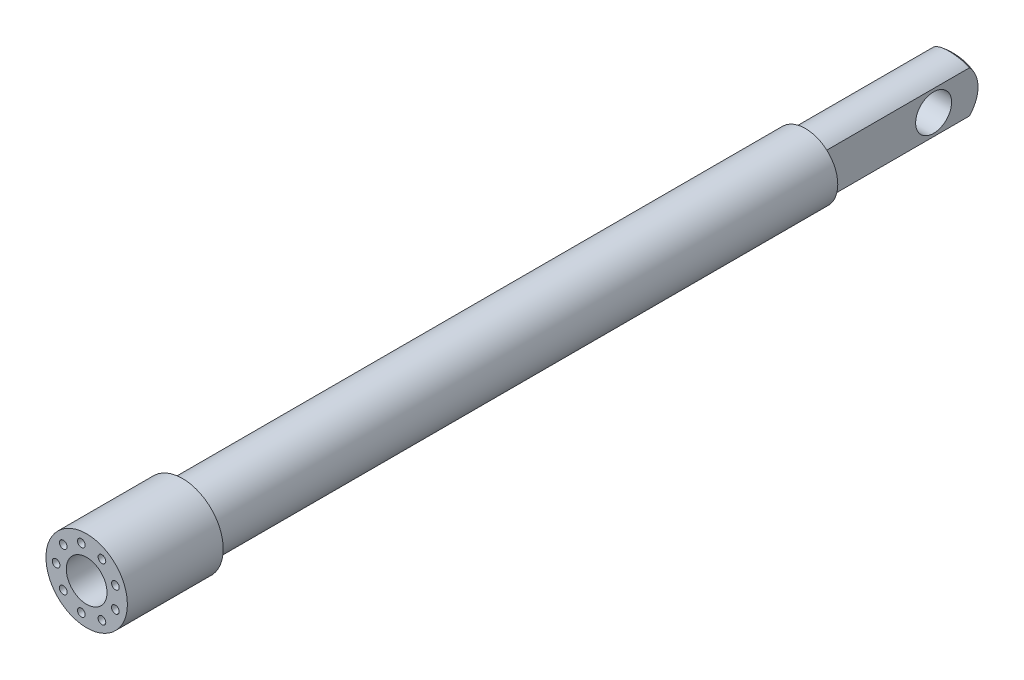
ISO-10303-21;
HEADER;
FILE_DESCRIPTION(('STEP AP214'),'2;1');
FILE_NAME('part.step','',(''),(''),'','','');
FILE_SCHEMA(('AUTOMOTIVE_DESIGN { 1 0 10303 214 1 1 1 1 }'));
ENDSEC;
DATA;
#1=APPLICATION_CONTEXT('core data for automotive mechanical design processes');
#2=APPLICATION_PROTOCOL_DEFINITION('international standard','automotive_design',2000,#1);
#3=PRODUCT_CONTEXT('',#1,'mechanical');
#4=PRODUCT('Part','Part','',(#3));
#5=PRODUCT_RELATED_PRODUCT_CATEGORY('part','',(#4));
#6=PRODUCT_DEFINITION_FORMATION('','',#4);
#7=PRODUCT_DEFINITION_CONTEXT('part definition',#1,'design');
#8=PRODUCT_DEFINITION('design','',#6,#7);
#9=PRODUCT_DEFINITION_SHAPE('','',#8);
#10=(LENGTH_UNIT() NAMED_UNIT(*) SI_UNIT(.MILLI.,.METRE.));
#11=(NAMED_UNIT(*) PLANE_ANGLE_UNIT() SI_UNIT($,.RADIAN.));
#12=(NAMED_UNIT(*) SI_UNIT($,.STERADIAN.) SOLID_ANGLE_UNIT());
#13=UNCERTAINTY_MEASURE_WITH_UNIT(LENGTH_MEASURE(1.E-05),#10,'distance_accuracy_value','');
#14=(GEOMETRIC_REPRESENTATION_CONTEXT(3) GLOBAL_UNCERTAINTY_ASSIGNED_CONTEXT((#13)) GLOBAL_UNIT_ASSIGNED_CONTEXT((#10,
#11,#12)) REPRESENTATION_CONTEXT('',''));
#15=CARTESIAN_POINT('',(0.,0.,0.));
#16=DIRECTION('',(0.,0.,1.));
#17=DIRECTION('',(1.,0.,0.));
#18=AXIS2_PLACEMENT_3D('',#15,#16,#17);
#19=CARTESIAN_POINT('',(0.,0.,-1850.));
#20=DIRECTION('',(0.,0.,1.));
#21=DIRECTION('',(1.,0.,0.));
#22=AXIS2_PLACEMENT_3D('',#19,#20,#21);
#23=CYLINDRICAL_SURFACE('',#22,57.5);
#24=CARTESIAN_POINT('',(-37.5,43.5889894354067,-1805.));
#25=CARTESIAN_POINT('',(-36.9034025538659,44.102251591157,-1804.83220902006));
#26=CARTESIAN_POINT('',(-36.2961876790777,44.6033262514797,-1804.66486884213));
#27=CARTESIAN_POINT('',(-35.061183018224,45.5805173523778,-1804.33216744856));
#28=CARTESIAN_POINT('',(-34.4333875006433,46.0566267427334,-1804.16680680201));
#29=CARTESIAN_POINT('',(-33.1581229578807,46.9830836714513,-1803.83921304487));
#30=CARTESIAN_POINT('',(-32.510651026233,47.4334273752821,-1803.67698040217));
#31=CARTESIAN_POINT('',(-31.1969594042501,48.3075793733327,-1803.35680326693));
#32=CARTESIAN_POINT('',(-30.5307389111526,48.7313865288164,-1803.19885895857));
#33=CARTESIAN_POINT('',(-29.1781653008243,49.5531329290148,-1802.88788306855));
#34=CARTESIAN_POINT('',(-28.491751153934,49.9509788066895,-1802.73487012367));
#35=CARTESIAN_POINT('',(-27.1019802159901,50.7184655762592,-1802.43549675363));
#36=CARTESIAN_POINT('',(-26.3986246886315,51.0881085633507,-1802.28913583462));
#37=CARTESIAN_POINT('',(-24.9759593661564,51.7984897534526,-1802.00421358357));
#38=CARTESIAN_POINT('',(-24.2566504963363,52.1392296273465,-1801.86565180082));
#39=CARTESIAN_POINT('',(-22.8031162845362,52.7911203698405,-1801.59745208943));
#40=CARTESIAN_POINT('',(-22.0688906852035,53.1022707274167,-1801.46781431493));
#41=CARTESIAN_POINT('',(-20.3368868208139,53.7940445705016,-1801.17656833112));
#42=CARTESIAN_POINT('',(-19.3336532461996,54.1627576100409,-1801.01890332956));
#43=CARTESIAN_POINT('',(-17.3054588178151,54.8444690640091,-1800.72400231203));
#44=CARTESIAN_POINT('',(-16.280497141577,55.1574653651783,-1800.58676707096));
#45=CARTESIAN_POINT('',(-14.2120401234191,55.7262808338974,-1800.33500942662));
#46=CARTESIAN_POINT('',(-13.1685445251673,55.9820992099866,-1800.22048733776));
#47=CARTESIAN_POINT('',(-11.0686702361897,56.4347919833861,-1800.01636212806));
#48=CARTESIAN_POINT('',(-10.0123221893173,56.631785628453,-1799.92670862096));
#49=CARTESIAN_POINT('',(-7.88839565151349,56.9664727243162,-1799.77362273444));
#50=CARTESIAN_POINT('',(-6.82081723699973,57.1041665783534,-1799.7101901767));
#51=CARTESIAN_POINT('',(-4.67838378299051,57.3194689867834,-1799.61072637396));
#52=CARTESIAN_POINT('',(-3.60352936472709,57.3970826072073,-1799.57469281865));
#53=CARTESIAN_POINT('',(-1.77007023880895,57.4777466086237,-1799.53721522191));
#54=CARTESIAN_POINT('',(-1.01223942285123,57.4960861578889,-1799.52868116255));
#55=CARTESIAN_POINT('',(0.50364962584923,57.502789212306,-1799.52556364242));
#56=CARTESIAN_POINT('',(1.26170786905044,57.4911510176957,-1799.53098097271));
#57=CARTESIAN_POINT('',(2.77645316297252,57.4379282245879,-1799.55571876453));
#58=CARTESIAN_POINT('',(3.53314035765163,57.3963469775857,-1799.57503767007));
#59=CARTESIAN_POINT('',(5.04388212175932,57.2833577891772,-1799.62739761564));
#60=CARTESIAN_POINT('',(5.79793642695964,57.2119469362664,-1799.66043999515));
#61=CARTESIAN_POINT('',(7.30241576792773,57.0394459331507,-1799.73996644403));
#62=CARTESIAN_POINT('',(8.05283818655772,56.9383369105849,-1799.78645906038));
#63=CARTESIAN_POINT('',(9.54827906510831,56.7067275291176,-1799.8924571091));
#64=CARTESIAN_POINT('',(10.2932969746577,56.5762242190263,-1799.95196384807));
#65=CARTESIAN_POINT('',(11.7764686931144,56.2861939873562,-1800.08344930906));
#66=CARTESIAN_POINT('',(12.5146232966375,56.1266704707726,-1800.15542656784));
#67=CARTESIAN_POINT('',(13.9829205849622,55.7790048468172,-1800.31122394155));
#68=CARTESIAN_POINT('',(14.7130625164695,55.5908600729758,-1800.39504515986));
#69=CARTESIAN_POINT('',(16.8566202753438,54.9933644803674,-1800.65916063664));
#70=CARTESIAN_POINT('',(18.2572548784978,54.5442381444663,-1800.85519324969));
#71=CARTESIAN_POINT('',(21.0149987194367,53.5422554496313,-1801.28377684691));
#72=CARTESIAN_POINT('',(22.3721049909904,52.9893920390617,-1801.51633031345));
#73=CARTESIAN_POINT('',(25.0348045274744,51.784578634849,-1802.01104852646));
#74=CARTESIAN_POINT('',(26.3404316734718,51.1326952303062,-1802.27319334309));
#75=CARTESIAN_POINT('',(28.8944989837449,49.7340606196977,-1802.82011242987));
#76=CARTESIAN_POINT('',(30.1429562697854,48.9873380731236,-1803.10487985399));
#77=CARTESIAN_POINT('',(31.8978062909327,47.8455031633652,-1803.52662848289));
#78=CARTESIAN_POINT('',(32.4296152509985,47.486643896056,-1803.65742605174));
#79=CARTESIAN_POINT('',(33.4804530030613,46.7516864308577,-1803.92141598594));
#80=CARTESIAN_POINT('',(33.9994843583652,46.3755917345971,-1804.05460786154));
#81=CARTESIAN_POINT('',(35.0232977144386,45.6073173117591,-1804.32250880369));
#82=CARTESIAN_POINT('',(35.5281075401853,45.2151733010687,-1804.45721406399));
#83=CARTESIAN_POINT('',(36.5242775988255,44.4143631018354,-1804.72784631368));
#84=CARTESIAN_POINT('',(37.0156352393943,44.0056937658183,-1804.86377353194));
#85=CARTESIAN_POINT('',(37.5,43.5889894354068,-1805.));
#86=B_SPLINE_CURVE_WITH_KNOTS('',3,(#24,#25,#26,#27,#28,#29,#30,#31,#32,#33,#34,#35,#36,#37,#38,
#39,#40,#41,#42,#43,#44,#45,#46,#47,#48,#49,#50,#51,#52,#53,#54,#55,#56,#57,#58,#59,#60,#61,#62,
#63,#64,#65,#66,#67,#68,#69,#70,#71,#72,#73,#74,#75,#76,#77,#78,#79,#80,#81,#82,#83,#84,#85),
.UNSPECIFIED.,.F.,.F.,(4,2,2,2,2,2,2,2,2,2,2,2,2,2,2,2,2,2,2,2,2,2,2,2,2,2,2,2,2,2,4),(0.,
2.4139037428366,4.82848554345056,7.24342576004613,9.65846953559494,12.0817678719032,
14.5048860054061,16.9278639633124,19.3508837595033,22.5902167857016,25.8296726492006,
29.0691733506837,32.3020617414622,35.5349281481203,38.7675219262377,41.0411580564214,
43.3149231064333,45.5884336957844,47.8621662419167,50.1373468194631,52.4127559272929,
54.6878982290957,56.9632526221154,61.4096497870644,65.8563493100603,70.3000716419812,
74.7424543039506,76.706457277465,78.6700629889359,80.6295141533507,82.589340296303),.UNSPECIFIED.);
#87=CARTESIAN_POINT('',(-37.5,43.5889894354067,-1805.));
#88=VERTEX_POINT('',#87);
#89=CARTESIAN_POINT('',(37.5,43.5889894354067,-1805.));
#90=VERTEX_POINT('',#89);
#91=EDGE_CURVE('E79',#88,#90,#86,.T.);
#92=ORIENTED_EDGE('',*,*,#91,.F.);
#93=DIRECTION('',(0.,0.,1.));
#94=VECTOR('',#93,1.);
#95=CARTESIAN_POINT('',(-37.5,43.5889894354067,-1850.));
#96=LINE('',#95,#94);
#97=CARTESIAN_POINT('',(-37.4999999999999,43.5889894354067,-1500.));
#98=VERTEX_POINT('',#97);
#99=EDGE_CURVE('E84',#88,#98,#96,.T.);
#100=ORIENTED_EDGE('',*,*,#99,.T.);
#101=CARTESIAN_POINT('',(0.,0.,-1500.));
#102=DIRECTION('',(0.,0.,1.));
#103=DIRECTION('',(1.,0.,0.));
#104=AXIS2_PLACEMENT_3D('',#101,#102,#103);
#105=CIRCLE('',#104,57.5);
#106=CARTESIAN_POINT('',(37.5,43.5889894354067,-1500.));
#107=VERTEX_POINT('',#106);
#108=EDGE_CURVE('E61',#98,#107,#105,.F.);
#109=ORIENTED_EDGE('',*,*,#108,.T.);
#110=DIRECTION('',(0.,0.,1.));
#111=VECTOR('',#110,1.);
#112=CARTESIAN_POINT('',(37.5,43.5889894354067,-1850.));
#113=LINE('',#112,#111);
#114=EDGE_CURVE('E86',#107,#90,#113,.F.);
#115=ORIENTED_EDGE('',*,*,#114,.T.);
#116=EDGE_LOOP('',(#92,#100,#109,#115));
#117=FACE_BOUND('',#116,.T.);
#118=ADVANCED_FACE('F34',(#117),#23,.T.);
#119=CARTESIAN_POINT('',(37.5,-43.5889894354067,-1805.));
#120=CARTESIAN_POINT('',(36.903402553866,-44.102251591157,-1804.83220902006));
#121=CARTESIAN_POINT('',(36.2961876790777,-44.6033262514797,-1804.66486884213));
#122=CARTESIAN_POINT('',(35.061183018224,-45.5805173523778,-1804.33216744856));
#123=CARTESIAN_POINT('',(34.4333875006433,-46.0566267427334,-1804.16680680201));
#124=CARTESIAN_POINT('',(33.1581229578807,-46.9830836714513,-1803.83921304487));
#125=CARTESIAN_POINT('',(32.510651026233,-47.4334273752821,-1803.67698040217));
#126=CARTESIAN_POINT('',(31.1969594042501,-48.3075793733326,-1803.35680326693));
#127=CARTESIAN_POINT('',(30.5307389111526,-48.7313865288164,-1803.19885895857));
#128=CARTESIAN_POINT('',(29.1781653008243,-49.5531329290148,-1802.88788306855));
#129=CARTESIAN_POINT('',(28.491751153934,-49.9509788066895,-1802.73487012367));
#130=CARTESIAN_POINT('',(27.1019802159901,-50.7184655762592,-1802.43549675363));
#131=CARTESIAN_POINT('',(26.3986246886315,-51.0881085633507,-1802.28913583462));
#132=CARTESIAN_POINT('',(24.9759593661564,-51.7984897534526,-1802.00421358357));
#133=CARTESIAN_POINT('',(24.2566504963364,-52.1392296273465,-1801.86565180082));
#134=CARTESIAN_POINT('',(22.8031162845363,-52.7911203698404,-1801.59745208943));
#135=CARTESIAN_POINT('',(22.0688906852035,-53.1022707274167,-1801.46781431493));
#136=CARTESIAN_POINT('',(20.3368868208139,-53.7940445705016,-1801.17656833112));
#137=CARTESIAN_POINT('',(19.3336532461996,-54.1627576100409,-1801.01890332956));
#138=CARTESIAN_POINT('',(17.3054588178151,-54.8444690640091,-1800.72400231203));
#139=CARTESIAN_POINT('',(16.280497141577,-55.1574653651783,-1800.58676707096));
#140=CARTESIAN_POINT('',(14.2120401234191,-55.7262808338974,-1800.33500942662));
#141=CARTESIAN_POINT('',(13.1685445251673,-55.9820992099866,-1800.22048733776));
#142=CARTESIAN_POINT('',(11.0686702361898,-56.4347919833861,-1800.01636212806));
#143=CARTESIAN_POINT('',(10.0123221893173,-56.631785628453,-1799.92670862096));
#144=CARTESIAN_POINT('',(7.88839565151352,-56.9664727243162,-1799.77362273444));
#145=CARTESIAN_POINT('',(6.82081723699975,-57.1041665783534,-1799.7101901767));
#146=CARTESIAN_POINT('',(4.67838378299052,-57.3194689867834,-1799.61072637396));
#147=CARTESIAN_POINT('',(3.6035293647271,-57.3970826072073,-1799.57469281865));
#148=CARTESIAN_POINT('',(1.77007023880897,-57.4777466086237,-1799.53721522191));
#149=CARTESIAN_POINT('',(1.01223942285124,-57.4960861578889,-1799.52868116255));
#150=CARTESIAN_POINT('',(-0.503649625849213,-57.502789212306,-1799.52556364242));
#151=CARTESIAN_POINT('',(-1.26170786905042,-57.4911510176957,-1799.53098097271));
#152=CARTESIAN_POINT('',(-2.7764531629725,-57.4379282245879,-1799.55571876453));
#153=CARTESIAN_POINT('',(-3.53314035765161,-57.3963469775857,-1799.57503767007));
#154=CARTESIAN_POINT('',(-5.04388212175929,-57.2833577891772,-1799.62739761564));
#155=CARTESIAN_POINT('',(-5.79793642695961,-57.2119469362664,-1799.66043999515));
#156=CARTESIAN_POINT('',(-7.30241576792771,-57.0394459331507,-1799.73996644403));
#157=CARTESIAN_POINT('',(-8.0528381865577,-56.9383369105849,-1799.78645906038));
#158=CARTESIAN_POINT('',(-9.54827906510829,-56.7067275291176,-1799.8924571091));
#159=CARTESIAN_POINT('',(-10.2932969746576,-56.5762242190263,-1799.95196384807));
#160=CARTESIAN_POINT('',(-11.7764686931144,-56.2861939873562,-1800.08344930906));
#161=CARTESIAN_POINT('',(-12.5146232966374,-56.1266704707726,-1800.15542656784));
#162=CARTESIAN_POINT('',(-13.9829205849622,-55.7790048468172,-1800.31122394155));
#163=CARTESIAN_POINT('',(-14.7130625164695,-55.5908600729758,-1800.39504515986));
#164=CARTESIAN_POINT('',(-16.8566202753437,-54.9933644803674,-1800.65916063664));
#165=CARTESIAN_POINT('',(-18.2572548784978,-54.5442381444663,-1800.85519324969));
#166=CARTESIAN_POINT('',(-21.0149987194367,-53.5422554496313,-1801.28377684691));
#167=CARTESIAN_POINT('',(-22.3721049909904,-52.9893920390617,-1801.51633031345));
#168=CARTESIAN_POINT('',(-25.0348045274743,-51.784578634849,-1802.01104852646));
#169=CARTESIAN_POINT('',(-26.3404316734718,-51.1326952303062,-1802.27319334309));
#170=CARTESIAN_POINT('',(-28.8944989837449,-49.7340606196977,-1802.82011242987));
#171=CARTESIAN_POINT('',(-30.1429562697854,-48.9873380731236,-1803.10487985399));
#172=CARTESIAN_POINT('',(-31.8978062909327,-47.8455031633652,-1803.52662848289));
#173=CARTESIAN_POINT('',(-32.4296152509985,-47.486643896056,-1803.65742605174));
#174=CARTESIAN_POINT('',(-33.4804530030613,-46.7516864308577,-1803.92141598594));
#175=CARTESIAN_POINT('',(-33.9994843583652,-46.3755917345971,-1804.05460786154));
#176=CARTESIAN_POINT('',(-35.0232977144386,-45.6073173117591,-1804.32250880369));
#177=CARTESIAN_POINT('',(-35.5281075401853,-45.2151733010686,-1804.45721406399));
#178=CARTESIAN_POINT('',(-36.5242775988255,-44.4143631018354,-1804.72784631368));
#179=CARTESIAN_POINT('',(-37.0156352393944,-44.0056937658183,-1804.86377353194));
#180=CARTESIAN_POINT('',(-37.5000000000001,-43.5889894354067,-1805.));
#181=B_SPLINE_CURVE_WITH_KNOTS('',3,(#119,#120,#121,#122,#123,#124,#125,#126,#127,#128,#129,
#130,#131,#132,#133,#134,#135,#136,#137,#138,#139,#140,#141,#142,#143,#144,#145,#146,#147,#148,
#149,#150,#151,#152,#153,#154,#155,#156,#157,#158,#159,#160,#161,#162,#163,#164,#165,#166,#167,
#168,#169,#170,#171,#172,#173,#174,#175,#176,#177,#178,#179,#180),.UNSPECIFIED.,.F.,.F.,(4,2,2,
2,2,2,2,2,2,2,2,2,2,2,2,2,2,2,2,2,2,2,2,2,2,2,2,2,2,2,4),(0.,2.41390374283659,4.82848554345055,
7.24342576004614,9.65846953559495,12.0817678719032,14.5048860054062,16.9278639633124,
19.3508837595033,22.5902167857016,25.8296726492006,29.0691733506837,32.3020617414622,
35.5349281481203,38.7675219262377,41.0411580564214,43.3149231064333,45.5884336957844,
47.8621662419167,50.1373468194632,52.4127559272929,54.6878982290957,56.9632526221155,
61.4096497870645,65.8563493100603,70.3000716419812,74.7424543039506,76.706457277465,
78.6700629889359,80.6295141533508,82.5893402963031),.UNSPECIFIED.);
#182=CARTESIAN_POINT('',(37.5,-43.5889894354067,-1805.));
#183=VERTEX_POINT('',#182);
#184=CARTESIAN_POINT('',(-37.5,-43.5889894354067,-1805.));
#185=VERTEX_POINT('',#184);
#186=EDGE_CURVE('E53',#183,#185,#181,.T.);
#187=ORIENTED_EDGE('',*,*,#186,.F.);
#188=DIRECTION('',(0.,0.,1.));
#189=VECTOR('',#188,1.);
#190=CARTESIAN_POINT('',(37.5,-43.5889894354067,-1850.));
#191=LINE('',#190,#189);
#192=CARTESIAN_POINT('',(37.5,-43.5889894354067,-1500.));
#193=VERTEX_POINT('',#192);
#194=EDGE_CURVE('E101',#183,#193,#191,.T.);
#195=ORIENTED_EDGE('',*,*,#194,.T.);
#196=CARTESIAN_POINT('',(-37.4999999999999,-43.5889894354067,-1500.));
#197=VERTEX_POINT('',#196);
#198=EDGE_CURVE('E47',#193,#197,#105,.F.);
#199=ORIENTED_EDGE('',*,*,#198,.T.);
#200=DIRECTION('',(0.,0.,1.));
#201=VECTOR('',#200,1.);
#202=CARTESIAN_POINT('',(-37.5,-43.5889894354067,-1850.));
#203=LINE('',#202,#201);
#204=EDGE_CURVE('E93',#197,#185,#203,.F.);
#205=ORIENTED_EDGE('',*,*,#204,.T.);
#206=EDGE_LOOP('',(#187,#195,#199,#205));
#207=FACE_BOUND('',#206,.T.);
#208=ADVANCED_FACE('F211',(#207),#23,.T.);
#209=CARTESIAN_POINT('',(37.5,-175.,-1500.));
#210=DIRECTION('',(-1.,0.,0.));
#211=DIRECTION('',(0.,0.,1.));
#212=AXIS2_PLACEMENT_3D('',#209,#210,#211);
#213=PLANE('',#212);
#214=CARTESIAN_POINT('',(37.4999999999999,0.,-1730.));
#215=DIRECTION('',(1.,0.,0.));
#216=DIRECTION('',(0.,0.,-1.));
#217=AXIS2_PLACEMENT_3D('',#214,#215,#216);
#218=CIRCLE('',#217,37.5);
#219=CARTESIAN_POINT('',(37.4999999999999,0.,-1767.5));
#220=VERTEX_POINT('',#219);
#221=EDGE_CURVE('E178',#220,#220,#218,.T.);
#222=ORIENTED_EDGE('',*,*,#221,.F.);
#223=EDGE_LOOP('',(#222));
#224=FACE_BOUND('',#223,.T.);
#225=CARTESIAN_POINT('',(37.5,43.5889894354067,-1805.));
#226=CARTESIAN_POINT('',(37.5,42.8851714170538,-1805.63914926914));
#227=CARTESIAN_POINT('',(37.5,42.1695481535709,-1806.26534991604));
#228=CARTESIAN_POINT('',(37.5,40.7146566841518,-1807.49079116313));
#229=CARTESIAN_POINT('',(37.5,39.9753709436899,-1808.09001093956));
#230=CARTESIAN_POINT('',(37.5,38.4739110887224,-1809.25967004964));
#231=CARTESIAN_POINT('',(37.5,37.7117285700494,-1809.83009860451));
#232=CARTESIAN_POINT('',(37.5,36.1653173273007,-1810.94041957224));
#233=CARTESIAN_POINT('',(37.5,35.3810865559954,-1811.48030913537));
#234=CARTESIAN_POINT('',(37.5,33.7874318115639,-1812.53053314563));
#235=CARTESIAN_POINT('',(37.5,32.9779014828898,-1813.04070632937));
#236=CARTESIAN_POINT('',(37.5,31.3384584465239,-1814.02685974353));
#237=CARTESIAN_POINT('',(37.5,30.5085493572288,-1814.502845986));
#238=CARTESIAN_POINT('',(37.5,28.8293549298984,-1815.41907135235));
#239=CARTESIAN_POINT('',(37.5,27.9800722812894,-1815.85931539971));
#240=CARTESIAN_POINT('',(37.5,26.2632183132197,-1816.70256401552));
#241=CARTESIAN_POINT('',(37.5,25.3956467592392,-1817.10556810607));
#242=CARTESIAN_POINT('',(37.5,23.3456041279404,-1818.00328125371));
#243=CARTESIAN_POINT('',(37.5,22.1563433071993,-1818.48259278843));
#244=CARTESIAN_POINT('',(37.5,19.7508275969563,-1819.36824458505));
#245=CARTESIAN_POINT('',(37.5,18.5345700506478,-1819.77457762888));
#246=CARTESIAN_POINT('',(37.5,16.0791537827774,-1820.51117698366));
#247=CARTESIAN_POINT('',(37.5,14.8399944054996,-1820.84144111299));
#248=CARTESIAN_POINT('',(37.5,12.3466774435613,-1821.42246818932));
#249=CARTESIAN_POINT('',(37.5,11.0925694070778,-1821.67344345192));
#250=CARTESIAN_POINT('',(37.5,8.57094200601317,-1822.09503486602));
#251=CARTESIAN_POINT('',(37.5,7.3034229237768,-1822.26565270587));
#252=CARTESIAN_POINT('',(37.5,4.7601270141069,-1822.52506829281));
#253=CARTESIAN_POINT('',(37.5,3.48435128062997,-1822.61387666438));
#254=CARTESIAN_POINT('',(37.5,1.34424004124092,-1822.69353704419));
#255=CARTESIAN_POINT('',(37.5,0.480672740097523,-1822.70681863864));
#256=CARTESIAN_POINT('',(37.5,-1.2462927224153,-1822.69567353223));
#257=CARTESIAN_POINT('',(37.5,-2.10969087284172,-1822.67124489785));
#258=CARTESIAN_POINT('',(37.5,-3.83447012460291,-1822.58477284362));
#259=CARTESIAN_POINT('',(37.5,-4.69585149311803,-1822.5227347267));
#260=CARTESIAN_POINT('',(37.5,-6.41518922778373,-1822.36128624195));
#261=CARTESIAN_POINT('',(37.5,-7.27314525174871,-1822.26187223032));
#262=CARTESIAN_POINT('',(37.5,-8.98441196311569,-1822.02599630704));
#263=CARTESIAN_POINT('',(37.5,-9.83771992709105,-1821.88951465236));
#264=CARTESIAN_POINT('',(37.5,-11.5377721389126,-1821.58003467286));
#265=CARTESIAN_POINT('',(37.5,-12.3845157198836,-1821.40703268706));
#266=CARTESIAN_POINT('',(37.5,-14.0697788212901,-1821.02519060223));
#267=CARTESIAN_POINT('',(37.5,-14.9082992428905,-1820.81635447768));
#268=CARTESIAN_POINT('',(37.5,-16.5758852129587,-1820.36357218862));
#269=CARTESIAN_POINT('',(37.5,-17.4049498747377,-1820.1196227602));
#270=CARTESIAN_POINT('',(37.5,-19.0332114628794,-1819.60351841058));
#271=CARTESIAN_POINT('',(37.5,-19.8326561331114,-1819.33214428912));
#272=CARTESIAN_POINT('',(37.5,-21.4201038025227,-1818.75758817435));
#273=CARTESIAN_POINT('',(37.5,-22.2081057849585,-1818.45440337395));
#274=CARTESIAN_POINT('',(37.5,-23.7715050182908,-1817.81720607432));
#275=CARTESIAN_POINT('',(37.5,-24.5469028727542,-1817.4831950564));
#276=CARTESIAN_POINT('',(37.5,-26.0841777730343,-1816.78533728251));
#277=CARTESIAN_POINT('',(37.5,-26.846053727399,-1816.4214881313));
#278=CARTESIAN_POINT('',(37.5,-29.1095191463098,-1815.2869892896));
#279=CARTESIAN_POINT('',(37.5,-30.5896683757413,-1814.47309266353));
#280=CARTESIAN_POINT('',(37.5,-33.4857301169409,-1812.73908218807));
#281=CARTESIAN_POINT('',(37.5,-34.9016577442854,-1811.8189935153));
#282=CARTESIAN_POINT('',(37.5,-36.9230866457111,-1810.40157458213));
#283=CARTESIAN_POINT('',(37.5,-37.5556632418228,-1809.94240002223));
#284=CARTESIAN_POINT('',(37.5,-38.8056715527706,-1809.0040657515));
#285=CARTESIAN_POINT('',(37.5,-39.4231060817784,-1808.52490979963));
#286=CARTESIAN_POINT('',(37.5,-40.6409825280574,-1807.54869922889));
#287=CARTESIAN_POINT('',(37.5,-41.2414647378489,-1807.05169480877));
#288=CARTESIAN_POINT('',(37.5,-42.4269372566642,-1806.03936524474));
#289=CARTESIAN_POINT('',(37.5,-43.0119252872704,-1805.52403743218));
#290=CARTESIAN_POINT('',(37.5,-43.5889894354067,-1805.));
#291=B_SPLINE_CURVE_WITH_KNOTS('',3,(#225,#226,#227,#228,#229,#230,#231,#232,#233,#234,#235,
#236,#237,#238,#239,#240,#241,#242,#243,#244,#245,#246,#247,#248,#249,#250,#251,#252,#253,#254,
#255,#256,#257,#258,#259,#260,#261,#262,#263,#264,#265,#266,#267,#268,#269,#270,#271,#272,#273,
#274,#275,#276,#277,#278,#279,#280,#281,#282,#283,#284,#285,#286,#287,#288,#289,#290),
.UNSPECIFIED.,.F.,.F.,(4,2,2,2,2,2,2,2,2,2,2,2,2,2,2,2,2,2,2,2,2,2,2,2,2,2,2,2,2,2,2,2,4),(0.,
2.8520545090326,5.70627376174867,8.5615537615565,11.4170997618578,14.2869227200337,
17.1562397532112,20.0251608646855,22.8941187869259,26.7383640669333,30.5829893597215,
34.4277249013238,38.2620761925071,42.0963469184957,45.9301196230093,48.5203758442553,
51.1107648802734,53.7007887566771,56.2910652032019,58.8827240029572,61.4746427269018,
64.0662741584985,66.6581466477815,69.1902073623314,71.7224917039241,74.2546544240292,
76.7870206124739,81.8494182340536,86.9106180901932,89.2552797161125,91.5995022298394,
93.9375811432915,96.2760019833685),.UNSPECIFIED.);
#292=EDGE_CURVE('E87',#90,#183,#291,.T.);
#293=ORIENTED_EDGE('',*,*,#292,.F.);
#294=ORIENTED_EDGE('',*,*,#114,.F.);
#295=DIRECTION('',(0.,1.,0.));
#296=VECTOR('',#295,1.);
#297=CARTESIAN_POINT('',(37.5,-175.,-1500.));
#298=LINE('',#297,#296);
#299=EDGE_CURVE('E92',#193,#107,#298,.T.);
#300=ORIENTED_EDGE('',*,*,#299,.F.);
#301=ORIENTED_EDGE('',*,*,#194,.F.);
#302=EDGE_LOOP('',(#293,#294,#300,#301));
#303=FACE_BOUND('',#302,.T.);
#304=ADVANCED_FACE('F195',(#224,#303),#213,.F.);
#305=CARTESIAN_POINT('',(-37.4999999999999,-175.,-1500.));
#306=DIRECTION('',(1.,0.,0.));
#307=DIRECTION('',(0.,0.,-1.));
#308=AXIS2_PLACEMENT_3D('',#305,#306,#307);
#309=PLANE('',#308);
#310=CARTESIAN_POINT('',(-37.5,0.,-1730.));
#311=DIRECTION('',(1.,0.,0.));
#312=DIRECTION('',(0.,0.,-1.));
#313=AXIS2_PLACEMENT_3D('',#310,#311,#312);
#314=CIRCLE('',#313,37.5);
#315=CARTESIAN_POINT('',(-37.5,0.,-1767.5));
#316=VERTEX_POINT('',#315);
#317=EDGE_CURVE('E176',#316,#316,#314,.T.);
#318=ORIENTED_EDGE('',*,*,#317,.T.);
#319=EDGE_LOOP('',(#318));
#320=FACE_BOUND('',#319,.T.);
#321=CARTESIAN_POINT('',(-37.5,-43.5889894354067,-1805.));
#322=CARTESIAN_POINT('',(-37.5,-42.8843805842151,-1805.63986747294));
#323=CARTESIAN_POINT('',(-37.5,-42.1679398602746,-1806.26675723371));
#324=CARTESIAN_POINT('',(-37.5,-40.7113595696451,-1807.49351542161));
#325=CARTESIAN_POINT('',(-37.5,-39.9712023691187,-1808.09336290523));
#326=CARTESIAN_POINT('',(-37.5,-38.4679486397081,-1809.26420954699));
#327=CARTESIAN_POINT('',(-37.5,-37.7048436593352,-1809.83519786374));
#328=CARTESIAN_POINT('',(-37.5,-36.1565399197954,-1810.94656423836));
#329=CARTESIAN_POINT('',(-37.5,-35.3713391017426,-1811.48693942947));
#330=CARTESIAN_POINT('',(-37.5,-33.7756862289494,-1812.53806299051));
#331=CARTESIAN_POINT('',(-37.5,-32.9651273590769,-1813.04864933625));
#332=CARTESIAN_POINT('',(-37.5,-31.323586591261,-1814.0355419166));
#333=CARTESIAN_POINT('',(-37.5,-30.4926083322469,-1814.51185420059));
#334=CARTESIAN_POINT('',(-37.5,-28.8112392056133,-1815.42863937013));
#335=CARTESIAN_POINT('',(-37.5,-27.9608510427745,-1815.86911721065));
#336=CARTESIAN_POINT('',(-37.5,-26.2417543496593,-1816.71273641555));
#337=CARTESIAN_POINT('',(-37.5,-25.3730455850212,-1817.11587730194));
#338=CARTESIAN_POINT('',(-37.5,-23.3202871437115,-1818.01380223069));
#339=CARTESIAN_POINT('',(-37.5,-22.1294365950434,-1818.4931469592));
#340=CARTESIAN_POINT('',(-37.5,-19.7207087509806,-1819.378670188));
#341=CARTESIAN_POINT('',(-37.5,-18.502828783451,-1819.78484141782));
#342=CARTESIAN_POINT('',(-37.5,-16.0441531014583,-1820.52091470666));
#343=CARTESIAN_POINT('',(-37.5,-14.8033567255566,-1820.85081456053));
#344=CARTESIAN_POINT('',(-37.5,-12.3067913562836,-1821.43090371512));
#345=CARTESIAN_POINT('',(-37.5,-11.0510721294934,-1821.6813068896));
#346=CARTESIAN_POINT('',(-37.5,-8.5262487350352,-1822.10154947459));
#347=CARTESIAN_POINT('',(-37.5,-7.25714485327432,-1822.27139060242));
#348=CARTESIAN_POINT('',(-37.5,-4.71072728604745,-1822.5290509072));
#349=CARTESIAN_POINT('',(-37.5,-3.43341470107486,-1822.6168808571));
#350=CARTESIAN_POINT('',(-37.5,-1.29189871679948,-1822.69469829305));
#351=CARTESIAN_POINT('',(-37.5,-0.42844677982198,-1822.70721688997));
#352=CARTESIAN_POINT('',(-37.5,1.29825484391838,-1822.69455728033));
#353=CARTESIAN_POINT('',(-37.5,2.161504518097,-1822.66937714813));
#354=CARTESIAN_POINT('',(-37.5,3.88595388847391,-1822.58141673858));
#355=CARTESIAN_POINT('',(-37.5,4.74715385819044,-1822.51864179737));
#356=CARTESIAN_POINT('',(-37.5,6.46609791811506,-1822.35573693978));
#357=CARTESIAN_POINT('',(-37.5,7.32384166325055,-1822.25560338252));
#358=CARTESIAN_POINT('',(-37.5,9.03465744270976,-1822.01830749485));
#359=CARTESIAN_POINT('',(-37.5,9.88772671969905,-1821.88112530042));
#360=CARTESIAN_POINT('',(-37.5,11.5872739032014,-1821.57026620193));
#361=CARTESIAN_POINT('',(-37.5,12.4337511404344,-1821.39658564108));
#362=CARTESIAN_POINT('',(-37.5,14.1184562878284,-1821.01341049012));
#363=CARTESIAN_POINT('',(-37.5,14.9566850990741,-1820.80391985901));
#364=CARTESIAN_POINT('',(-37.5,16.6236643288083,-1820.34985429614));
#365=CARTESIAN_POINT('',(-37.5,17.4524138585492,-1820.10527610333));
#366=CARTESIAN_POINT('',(-37.5,19.080239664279,-1819.58788946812));
#367=CARTESIAN_POINT('',(-37.5,19.8795614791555,-1819.31585275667));
#368=CARTESIAN_POINT('',(-37.5,21.466739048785,-1818.73998220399));
#369=CARTESIAN_POINT('',(-37.5,22.254593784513,-1818.43614555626));
#370=CARTESIAN_POINT('',(-37.5,23.8176758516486,-1817.79765676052));
#371=CARTESIAN_POINT('',(-37.5,24.5929037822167,-1817.46300607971));
#372=CARTESIAN_POINT('',(-37.5,26.1298172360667,-1816.76388250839));
#373=CARTESIAN_POINT('',(-37.5,26.8915016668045,-1816.39940722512));
#374=CARTESIAN_POINT('',(-37.5,29.1543501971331,-1815.26305855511));
#375=CARTESIAN_POINT('',(-37.5,30.6340441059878,-1814.44796107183));
#376=CARTESIAN_POINT('',(-37.5,33.5291266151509,-1812.71161614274));
#377=CARTESIAN_POINT('',(-37.5,34.9445304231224,-1811.79039398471));
#378=CARTESIAN_POINT('',(-37.5,36.9615482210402,-1810.37389813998));
#379=CARTESIAN_POINT('',(-37.5,37.5903435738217,-1809.91686917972));
#380=CARTESIAN_POINT('',(-37.5,38.8329500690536,-1808.98306094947));
#381=CARTESIAN_POINT('',(-37.5,39.4467639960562,-1808.50628539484));
#382=CARTESIAN_POINT('',(-37.5,40.6575813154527,-1807.53504459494));
#383=CARTESIAN_POINT('',(-37.5,41.2546244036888,-1807.04062877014));
#384=CARTESIAN_POINT('',(-37.5,42.433388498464,-1806.03368169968));
#385=CARTESIAN_POINT('',(-37.5,43.0151072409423,-1805.52114780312));
#386=CARTESIAN_POINT('',(-37.5,43.5889894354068,-1805.));
#387=B_SPLINE_CURVE_WITH_KNOTS('',3,(#321,#322,#323,#324,#325,#326,#327,#328,#329,#330,#331,
#332,#333,#334,#335,#336,#337,#338,#339,#340,#341,#342,#343,#344,#345,#346,#347,#348,#349,#350,
#351,#352,#353,#354,#355,#356,#357,#358,#359,#360,#361,#362,#363,#364,#365,#366,#367,#368,#369,
#370,#371,#372,#373,#374,#375,#376,#377,#378,#379,#380,#381,#382,#383,#384,#385,#386),
.UNSPECIFIED.,.F.,.F.,(4,2,2,2,2,2,2,2,2,2,2,2,2,2,2,2,2,2,2,2,2,2,2,2,2,2,2,2,2,2,2,2,4),(0.,
2.85525905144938,5.71269271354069,8.5711919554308,11.429958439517,14.3030498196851,
17.1756328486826,20.0478179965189,22.9200399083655,26.7687370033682,30.617816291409,
34.4670068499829,38.3057522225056,42.1444157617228,45.98257498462,48.5724515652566,
51.1624604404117,53.7521017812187,56.3419955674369,58.9332807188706,61.5248256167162,
64.1160841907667,66.707583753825,69.239935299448,71.7725105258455,74.3049652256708,
76.8376232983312,81.9005639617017,86.9623006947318,89.2940078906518,91.6252783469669,
93.9504638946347,96.2759910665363),.UNSPECIFIED.);
#388=EDGE_CURVE('E12',#185,#88,#387,.T.);
#389=ORIENTED_EDGE('',*,*,#388,.F.);
#390=ORIENTED_EDGE('',*,*,#204,.F.);
#391=DIRECTION('',(0.,1.,0.));
#392=VECTOR('',#391,1.);
#393=CARTESIAN_POINT('',(-37.4999999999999,-175.,-1500.));
#394=LINE('',#393,#392);
#395=EDGE_CURVE('E91',#197,#98,#394,.T.);
#396=ORIENTED_EDGE('',*,*,#395,.T.);
#397=ORIENTED_EDGE('',*,*,#99,.F.);
#398=EDGE_LOOP('',(#389,#390,#396,#397));
#399=FACE_BOUND('',#398,.T.);
#400=ADVANCED_FACE('F89',(#320,#399),#309,.F.);
#401=CARTESIAN_POINT('',(0.,0.,-1500.));
#402=DIRECTION('',(0.,0.,1.));
#403=DIRECTION('',(1.,0.,0.));
#404=AXIS2_PLACEMENT_3D('',#401,#402,#403);
#405=PLANE('',#404);
#406=ORIENTED_EDGE('',*,*,#395,.F.);
#407=ORIENTED_EDGE('',*,*,#198,.F.);
#408=ORIENTED_EDGE('',*,*,#299,.T.);
#409=ORIENTED_EDGE('',*,*,#108,.F.);
#410=EDGE_LOOP('',(#406,#407,#408,#409));
#411=FACE_BOUND('',#410,.T.);
#412=CARTESIAN_POINT('',(0.,0.,-1500.));
#413=DIRECTION('',(0.,0.,1.));
#414=DIRECTION('',(1.,0.,0.));
#415=AXIS2_PLACEMENT_3D('',#412,#413,#414);
#416=CIRCLE('',#415,67.5);
#417=CARTESIAN_POINT('',(67.5,0.,-1500.));
#418=VERTEX_POINT('',#417);
#419=EDGE_CURVE('E163',#418,#418,#416,.T.);
#420=ORIENTED_EDGE('',*,*,#419,.F.);
#421=EDGE_LOOP('',(#420));
#422=FACE_BOUND('',#421,.T.);
#423=ADVANCED_FACE('F294',(#411,#422),#405,.F.);
#424=CARTESIAN_POINT('',(0.,0.,-200.));
#425=DIRECTION('',(0.,0.,1.));
#426=DIRECTION('',(1.,0.,0.));
#427=AXIS2_PLACEMENT_3D('',#424,#425,#426);
#428=CYLINDRICAL_SURFACE('',#427,85.);
#429=CARTESIAN_POINT('',(0.,0.,-200.));
#430=DIRECTION('',(0.,0.,1.));
#431=DIRECTION('',(1.,0.,0.));
#432=AXIS2_PLACEMENT_3D('',#429,#430,#431);
#433=CIRCLE('',#432,85.);
#434=CARTESIAN_POINT('',(85.,0.,-200.));
#435=VERTEX_POINT('',#434);
#436=EDGE_CURVE('E172',#435,#435,#433,.T.);
#437=ORIENTED_EDGE('',*,*,#436,.T.);
#438=EDGE_LOOP('',(#437));
#439=FACE_BOUND('',#438,.T.);
#440=CARTESIAN_POINT('',(0.,0.,0.));
#441=DIRECTION('',(0.,0.,1.));
#442=DIRECTION('',(1.,0.,0.));
#443=AXIS2_PLACEMENT_3D('',#440,#441,#442);
#444=CIRCLE('',#443,85.);
#445=CARTESIAN_POINT('',(85.,0.,0.));
#446=VERTEX_POINT('',#445);
#447=EDGE_CURVE('E169',#446,#446,#444,.T.);
#448=ORIENTED_EDGE('',*,*,#447,.F.);
#449=EDGE_LOOP('',(#448));
#450=FACE_BOUND('',#449,.T.);
#451=ADVANCED_FACE('F36',(#439,#450),#428,.T.);
#452=CARTESIAN_POINT('',(0.,0.,-200.));
#453=DIRECTION('',(0.,0.,1.));
#454=DIRECTION('',(1.,0.,0.));
#455=AXIS2_PLACEMENT_3D('',#452,#453,#454);
#456=PLANE('',#455);
#457=CARTESIAN_POINT('',(0.,0.,-200.));
#458=DIRECTION('',(0.,0.,1.));
#459=DIRECTION('',(1.,0.,0.));
#460=AXIS2_PLACEMENT_3D('',#457,#458,#459);
#461=CIRCLE('',#460,67.5);
#462=CARTESIAN_POINT('',(67.5,0.,-200.));
#463=VERTEX_POINT('',#462);
#464=EDGE_CURVE('E166',#463,#463,#461,.T.);
#465=ORIENTED_EDGE('',*,*,#464,.T.);
#466=EDGE_LOOP('',(#465));
#467=FACE_BOUND('',#466,.T.);
#468=ORIENTED_EDGE('',*,*,#436,.F.);
#469=EDGE_LOOP('',(#468));
#470=FACE_BOUND('',#469,.T.);
#471=ADVANCED_FACE('F303',(#467,#470),#456,.F.);
#472=CARTESIAN_POINT('',(0.,0.,0.));
#473=DIRECTION('',(0.,0.,1.));
#474=DIRECTION('',(1.,0.,0.));
#475=AXIS2_PLACEMENT_3D('',#472,#473,#474);
#476=PLANE('',#475);
#477=CARTESIAN_POINT('',(-48.8353332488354,40.9777101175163,0.));
#478=DIRECTION('',(0.,0.,1.));
#479=DIRECTION('',(0.766044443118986,-0.64278760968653,0.));
#480=AXIS2_PLACEMENT_3D('',#477,#478,#479);
#481=CIRCLE('',#480,8.);
#482=CARTESIAN_POINT('',(-42.7069777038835,35.835409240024,0.));
#483=VERTEX_POINT('',#482);
#484=EDGE_CURVE('E103',#483,#483,#481,.T.);
#485=ORIENTED_EDGE('',*,*,#484,.F.);
#486=EDGE_LOOP('',(#485));
#487=FACE_BOUND('',#486,.T.);
#488=CARTESIAN_POINT('',(-11.0700713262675,62.7814942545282,0.));
#489=DIRECTION('',(0.,0.,1.));
#490=DIRECTION('',(0.17364817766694,-0.984807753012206,0.));
#491=AXIS2_PLACEMENT_3D('',#488,#489,#490);
#492=CIRCLE('',#491,8.);
#493=CARTESIAN_POINT('',(-9.68088590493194,54.9030322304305,0.));
#494=VERTEX_POINT('',#493);
#495=EDGE_CURVE('E109',#494,#494,#492,.T.);
#496=ORIENTED_EDGE('',*,*,#495,.F.);
#497=EDGE_LOOP('',(#496));
#498=FACE_BOUND('',#497,.T.);
#499=CARTESIAN_POINT('',(31.8749999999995,55.2091194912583,0.));
#500=DIRECTION('',(0.,0.,1.));
#501=DIRECTION('',(-0.499999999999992,-0.866025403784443,0.));
#502=AXIS2_PLACEMENT_3D('',#499,#500,#501);
#503=CIRCLE('',#502,8.);
#504=CARTESIAN_POINT('',(27.8749999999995,48.2809162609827,0.));
#505=VERTEX_POINT('',#504);
#506=EDGE_CURVE('E115',#505,#505,#503,.T.);
#507=ORIENTED_EDGE('',*,*,#506,.F.);
#508=EDGE_LOOP('',(#507));
#509=FACE_BOUND('',#508,.T.);
#510=CARTESIAN_POINT('',(59.9054045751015,21.8037841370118,0.));
#511=DIRECTION('',(0.,0.,1.));
#512=DIRECTION('',(-0.939692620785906,-0.342020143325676,0.));
#513=AXIS2_PLACEMENT_3D('',#510,#511,#512);
#514=CIRCLE('',#513,8.);
#515=CARTESIAN_POINT('',(52.3878636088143,19.0676229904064,0.));
#516=VERTEX_POINT('',#515);
#517=EDGE_CURVE('E121',#516,#516,#514,.T.);
#518=ORIENTED_EDGE('',*,*,#517,.F.);
#519=EDGE_LOOP('',(#518));
#520=FACE_BOUND('',#519,.T.);
#521=CARTESIAN_POINT('',(59.9054045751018,-21.803784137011,0.));
#522=DIRECTION('',(0.,0.,1.));
#523=DIRECTION('',(-0.939692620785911,0.342020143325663,0.));
#524=AXIS2_PLACEMENT_3D('',#521,#522,#523);
#525=CIRCLE('',#524,8.);
#526=CARTESIAN_POINT('',(52.3878636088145,-19.0676229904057,0.));
#527=VERTEX_POINT('',#526);
#528=EDGE_CURVE('E127',#527,#527,#525,.T.);
#529=ORIENTED_EDGE('',*,*,#528,.F.);
#530=EDGE_LOOP('',(#529));
#531=FACE_BOUND('',#530,.T.);
#532=CARTESIAN_POINT('',(31.8750000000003,-55.2091194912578,0.));
#533=DIRECTION('',(0.,0.,1.));
#534=DIRECTION('',(-0.500000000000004,0.866025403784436,0.));
#535=AXIS2_PLACEMENT_3D('',#532,#533,#534);
#536=CIRCLE('',#535,8.);
#537=CARTESIAN_POINT('',(27.8750000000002,-48.2809162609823,0.));
#538=VERTEX_POINT('',#537);
#539=EDGE_CURVE('E133',#538,#538,#536,.T.);
#540=ORIENTED_EDGE('',*,*,#539,.F.);
#541=EDGE_LOOP('',(#540));
#542=FACE_BOUND('',#541,.T.);
#543=CARTESIAN_POINT('',(-11.0700713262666,-62.7814942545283,0.));
#544=DIRECTION('',(0.,0.,1.));
#545=DIRECTION('',(0.173648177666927,0.984807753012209,0.));
#546=AXIS2_PLACEMENT_3D('',#543,#544,#545);
#547=CIRCLE('',#546,8.);
#548=CARTESIAN_POINT('',(-9.68088590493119,-54.9030322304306,0.));
#549=VERTEX_POINT('',#548);
#550=EDGE_CURVE('E139',#549,#549,#547,.T.);
#551=ORIENTED_EDGE('',*,*,#550,.F.);
#552=EDGE_LOOP('',(#551));
#553=FACE_BOUND('',#552,.T.);
#554=CARTESIAN_POINT('',(-48.8353332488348,-40.977710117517,0.));
#555=DIRECTION('',(0.,0.,1.));
#556=DIRECTION('',(0.766044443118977,0.642787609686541,0.));
#557=AXIS2_PLACEMENT_3D('',#554,#555,#556);
#558=CIRCLE('',#557,8.);
#559=CARTESIAN_POINT('',(-42.706977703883,-35.8354092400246,0.));
#560=VERTEX_POINT('',#559);
#561=EDGE_CURVE('E145',#560,#560,#558,.T.);
#562=ORIENTED_EDGE('',*,*,#561,.F.);
#563=EDGE_LOOP('',(#562));
#564=FACE_BOUND('',#563,.T.);
#565=CARTESIAN_POINT('',(-63.75,0.,0.));
#566=DIRECTION('',(0.,0.,1.));
#567=DIRECTION('',(1.,0.,0.));
#568=AXIS2_PLACEMENT_3D('',#565,#566,#567);
#569=CIRCLE('',#568,8.);
#570=CARTESIAN_POINT('',(-55.75,0.,0.));
#571=VERTEX_POINT('',#570);
#572=EDGE_CURVE('E151',#571,#571,#569,.T.);
#573=ORIENTED_EDGE('',*,*,#572,.F.);
#574=EDGE_LOOP('',(#573));
#575=FACE_BOUND('',#574,.T.);
#576=CARTESIAN_POINT('',(0.,0.,0.));
#577=DIRECTION('',(0.,0.,1.));
#578=DIRECTION('',(1.,0.,0.));
#579=AXIS2_PLACEMENT_3D('',#576,#577,#578);
#580=CIRCLE('',#579,42.5);
#581=CARTESIAN_POINT('',(42.5,0.,-2.22044604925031E-13));
#582=VERTEX_POINT('',#581);
#583=EDGE_CURVE('E157',#582,#582,#580,.T.);
#584=ORIENTED_EDGE('',*,*,#583,.F.);
#585=EDGE_LOOP('',(#584));
#586=FACE_BOUND('',#585,.T.);
#587=ORIENTED_EDGE('',*,*,#447,.T.);
#588=EDGE_LOOP('',(#587));
#589=FACE_BOUND('',#588,.T.);
#590=ADVANCED_FACE('F300',(#487,#498,#509,#520,#531,#542,#553,#564,#575,#586,#589),#476,.T.);
#591=CARTESIAN_POINT('',(0.,0.,-1500.));
#592=DIRECTION('',(0.,0.,1.));
#593=DIRECTION('',(1.,0.,0.));
#594=AXIS2_PLACEMENT_3D('',#591,#592,#593);
#595=CYLINDRICAL_SURFACE('',#594,67.5);
#596=ORIENTED_EDGE('',*,*,#419,.T.);
#597=EDGE_LOOP('',(#596));
#598=FACE_BOUND('',#597,.T.);
#599=ORIENTED_EDGE('',*,*,#464,.F.);
#600=EDGE_LOOP('',(#599));
#601=FACE_BOUND('',#600,.T.);
#602=ADVANCED_FACE('F292',(#598,#601),#595,.T.);
#603=CARTESIAN_POINT('',(0.,0.,-1620.20815280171));
#604=DIRECTION('',(0.,0.,1.));
#605=DIRECTION('',(1.,0.,0.));
#606=AXIS2_PLACEMENT_3D('',#603,#604,#605);
#607=CYLINDRICAL_SURFACE('',#606,42.5);
#608=CARTESIAN_POINT('',(0.,0.,-1470.));
#609=DIRECTION('',(0.,0.,1.));
#610=DIRECTION('',(1.,0.,0.));
#611=AXIS2_PLACEMENT_3D('',#608,#609,#610);
#612=CIRCLE('',#611,42.5);
#613=CARTESIAN_POINT('',(42.5,0.,-1470.));
#614=VERTEX_POINT('',#613);
#615=EDGE_CURVE('E160',#614,#614,#612,.F.);
#616=CARTESIAN_POINT('',(42.5,0.,-1470.));
#617=CARTESIAN_POINT('',(42.5,0.,-1454.6875));
#618=CARTESIAN_POINT('',(42.5,0.,-1439.375));
#619=CARTESIAN_POINT('',(42.5,0.,-1408.75));
#620=CARTESIAN_POINT('',(42.5,0.,-1393.4375));
#621=CARTESIAN_POINT('',(42.5,0.,-1362.8125));
#622=CARTESIAN_POINT('',(42.5,0.,-1347.5));
#623=CARTESIAN_POINT('',(42.5,0.,-1316.875));
#624=CARTESIAN_POINT('',(42.5,0.,-1301.5625));
#625=CARTESIAN_POINT('',(42.5,0.,-1270.9375));
#626=CARTESIAN_POINT('',(42.5,0.,-1255.625));
#627=CARTESIAN_POINT('',(42.5,0.,-1225.));
#628=CARTESIAN_POINT('',(42.5,0.,-1209.6875));
#629=CARTESIAN_POINT('',(42.5,0.,-1179.0625));
#630=CARTESIAN_POINT('',(42.5,0.,-1163.75));
#631=CARTESIAN_POINT('',(42.5,0.,-1133.125));
#632=CARTESIAN_POINT('',(42.5,0.,-1117.8125));
#633=CARTESIAN_POINT('',(42.5,0.,-1087.1875));
#634=CARTESIAN_POINT('',(42.5,0.,-1071.875));
#635=CARTESIAN_POINT('',(42.5,0.,-1041.25));
#636=CARTESIAN_POINT('',(42.5,0.,-1025.9375));
#637=CARTESIAN_POINT('',(42.5,0.,-995.3125));
#638=CARTESIAN_POINT('',(42.5,0.,-980.));
#639=CARTESIAN_POINT('',(42.5,0.,-949.375));
#640=CARTESIAN_POINT('',(42.5,0.,-934.0625));
#641=CARTESIAN_POINT('',(42.5,0.,-903.4375));
#642=CARTESIAN_POINT('',(42.5,0.,-888.125));
#643=CARTESIAN_POINT('',(42.5,0.,-857.5));
#644=CARTESIAN_POINT('',(42.5,0.,-842.1875));
#645=CARTESIAN_POINT('',(42.5,0.,-811.5625));
#646=CARTESIAN_POINT('',(42.5,0.,-796.25));
#647=CARTESIAN_POINT('',(42.5,0.,-765.625));
#648=CARTESIAN_POINT('',(42.5,0.,-750.3125));
#649=CARTESIAN_POINT('',(42.5,0.,-719.6875));
#650=CARTESIAN_POINT('',(42.5,0.,-704.375));
#651=CARTESIAN_POINT('',(42.5,0.,-673.75));
#652=CARTESIAN_POINT('',(42.5,0.,-658.4375));
#653=CARTESIAN_POINT('',(42.5,0.,-627.8125));
#654=CARTESIAN_POINT('',(42.5,0.,-612.5));
#655=CARTESIAN_POINT('',(42.5,0.,-581.875));
#656=CARTESIAN_POINT('',(42.5,0.,-566.5625));
#657=CARTESIAN_POINT('',(42.5,0.,-535.9375));
#658=CARTESIAN_POINT('',(42.5,0.,-520.625));
#659=CARTESIAN_POINT('',(42.5,0.,-490.));
#660=CARTESIAN_POINT('',(42.5,0.,-474.6875));
#661=CARTESIAN_POINT('',(42.5,0.,-444.0625));
#662=CARTESIAN_POINT('',(42.5,0.,-428.75));
#663=CARTESIAN_POINT('',(42.5,0.,-398.125));
#664=CARTESIAN_POINT('',(42.5,0.,-382.8125));
#665=CARTESIAN_POINT('',(42.5,0.,-352.1875));
#666=CARTESIAN_POINT('',(42.5,0.,-336.875));
#667=CARTESIAN_POINT('',(42.5,0.,-306.25));
#668=CARTESIAN_POINT('',(42.5,0.,-290.9375));
#669=CARTESIAN_POINT('',(42.5,0.,-260.3125));
#670=CARTESIAN_POINT('',(42.5,0.,-245.));
#671=CARTESIAN_POINT('',(42.5,0.,-214.375));
#672=CARTESIAN_POINT('',(42.5,0.,-199.0625));
#673=CARTESIAN_POINT('',(42.5,0.,-168.4375));
#674=CARTESIAN_POINT('',(42.5,0.,-153.125));
#675=CARTESIAN_POINT('',(42.5,0.,-122.5));
#676=CARTESIAN_POINT('',(42.5,0.,-107.1875));
#677=CARTESIAN_POINT('',(42.5,0.,-76.5625000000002));
#678=CARTESIAN_POINT('',(42.5,0.,-61.2500000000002));
#679=CARTESIAN_POINT('',(42.5,0.,-30.6250000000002));
#680=CARTESIAN_POINT('',(42.5,0.,-15.3125000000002));
#681=CARTESIAN_POINT('',(42.5,0.,-2.22044604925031E-13));
#682=B_SPLINE_CURVE_WITH_KNOTS('',3,(#616,#617,#618,#619,#620,#621,#622,#623,#624,#625,#626,
#627,#628,#629,#630,#631,#632,#633,#634,#635,#636,#637,#638,#639,#640,#641,#642,#643,#644,#645,
#646,#647,#648,#649,#650,#651,#652,#653,#654,#655,#656,#657,#658,#659,#660,#661,#662,#663,#664,
#665,#666,#667,#668,#669,#670,#671,#672,#673,#674,#675,#676,#677,#678,#679,#680,#681),
.UNSPECIFIED.,.F.,.F.,(4,2,2,2,2,2,2,2,2,2,2,2,2,2,2,2,2,2,2,2,2,2,2,2,2,2,2,2,2,2,2,2,4),(0.,
45.9375,91.8749999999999,137.8125,183.75,229.6875,275.625,321.5625,367.5,413.4375,459.375,
505.3125,551.25,597.1875,643.125,689.0625,735.,780.9375,826.875,872.8125,918.75,964.6875,
1010.625,1056.5625,1102.5,1148.4375,1194.375,1240.3125,1286.25,1332.1875,1378.125,1424.0625,
1470.),.UNSPECIFIED.);
#683=EDGE_CURVE('BSEAM288',#614,#582,#682,.T.);
#684=ORIENTED_EDGE('',*,*,#615,.T.);
#685=ORIENTED_EDGE('',*,*,#583,.T.);
#686=ORIENTED_EDGE('',*,*,#683,.T.);
#687=ORIENTED_EDGE('',*,*,#683,.F.);
#688=EDGE_LOOP('',(#684,#686,#685,#687));
#689=FACE_BOUND('',#688,.T.);
#690=ADVANCED_FACE('F288',(#689),#607,.F.);
#691=CARTESIAN_POINT('',(0.,0.,-1470.));
#692=DIRECTION('',(0.,0.,1.));
#693=DIRECTION('',(1.,0.,0.));
#694=AXIS2_PLACEMENT_3D('',#691,#692,#693);
#695=PLANE('',#694);
#696=ORIENTED_EDGE('',*,*,#615,.F.);
#697=EDGE_LOOP('',(#696));
#698=FACE_BOUND('',#697,.T.);
#699=ADVANCED_FACE('F284',(#698),#695,.T.);
#700=CARTESIAN_POINT('',(-63.75,0.,-85.));
#701=DIRECTION('',(0.,0.,1.));
#702=DIRECTION('',(1.,0.,0.));
#703=AXIS2_PLACEMENT_3D('',#700,#701,#702);
#704=CYLINDRICAL_SURFACE('',#703,8.);
#705=CARTESIAN_POINT('',(-63.75,0.,-85.));
#706=DIRECTION('',(0.,0.,1.));
#707=DIRECTION('',(1.,0.,0.));
#708=AXIS2_PLACEMENT_3D('',#705,#706,#707);
#709=CIRCLE('',#708,8.);
#710=CARTESIAN_POINT('',(-55.75,0.,-85.));
#711=VERTEX_POINT('',#710);
#712=EDGE_CURVE('E154',#711,#711,#709,.T.);
#713=ORIENTED_EDGE('',*,*,#712,.F.);
#714=EDGE_LOOP('',(#713));
#715=FACE_BOUND('',#714,.T.);
#716=ORIENTED_EDGE('',*,*,#572,.T.);
#717=EDGE_LOOP('',(#716));
#718=FACE_BOUND('',#717,.T.);
#719=ADVANCED_FACE('F280',(#715,#718),#704,.F.);
#720=CARTESIAN_POINT('',(-63.75,0.,-85.));
#721=DIRECTION('',(0.,0.,1.));
#722=DIRECTION('',(1.,0.,0.));
#723=AXIS2_PLACEMENT_3D('',#720,#721,#722);
#724=PLANE('',#723);
#725=ORIENTED_EDGE('',*,*,#712,.T.);
#726=EDGE_LOOP('',(#725));
#727=FACE_BOUND('',#726,.T.);
#728=ADVANCED_FACE('F276',(#727),#724,.T.);
#729=CARTESIAN_POINT('',(-48.8353332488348,-40.977710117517,-85.));
#730=DIRECTION('',(0.,0.,1.));
#731=DIRECTION('',(1.,0.,0.));
#732=AXIS2_PLACEMENT_3D('',#729,#730,#731);
#733=CYLINDRICAL_SURFACE('',#732,8.);
#734=CARTESIAN_POINT('',(-48.8353332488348,-40.977710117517,-85.));
#735=DIRECTION('',(0.,0.,1.));
#736=DIRECTION('',(0.766044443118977,0.642787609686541,0.));
#737=AXIS2_PLACEMENT_3D('',#734,#735,#736);
#738=CIRCLE('',#737,8.);
#739=CARTESIAN_POINT('',(-42.706977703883,-35.8354092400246,-85.));
#740=VERTEX_POINT('',#739);
#741=EDGE_CURVE('E148',#740,#740,#738,.T.);
#742=ORIENTED_EDGE('',*,*,#741,.F.);
#743=EDGE_LOOP('',(#742));
#744=FACE_BOUND('',#743,.T.);
#745=ORIENTED_EDGE('',*,*,#561,.T.);
#746=EDGE_LOOP('',(#745));
#747=FACE_BOUND('',#746,.T.);
#748=ADVANCED_FACE('F272',(#744,#747),#733,.F.);
#749=CARTESIAN_POINT('',(-48.8353332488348,-40.977710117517,-85.));
#750=DIRECTION('',(0.,0.,1.));
#751=DIRECTION('',(0.766044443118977,0.642787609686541,0.));
#752=AXIS2_PLACEMENT_3D('',#749,#750,#751);
#753=PLANE('',#752);
#754=ORIENTED_EDGE('',*,*,#741,.T.);
#755=EDGE_LOOP('',(#754));
#756=FACE_BOUND('',#755,.T.);
#757=ADVANCED_FACE('F268',(#756),#753,.T.);
#758=CARTESIAN_POINT('',(-11.0700713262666,-62.7814942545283,-85.));
#759=DIRECTION('',(0.,0.,1.));
#760=DIRECTION('',(1.,0.,0.));
#761=AXIS2_PLACEMENT_3D('',#758,#759,#760);
#762=CYLINDRICAL_SURFACE('',#761,8.);
#763=CARTESIAN_POINT('',(-11.0700713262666,-62.7814942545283,-85.));
#764=DIRECTION('',(0.,0.,1.));
#765=DIRECTION('',(0.173648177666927,0.984807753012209,0.));
#766=AXIS2_PLACEMENT_3D('',#763,#764,#765);
#767=CIRCLE('',#766,8.);
#768=CARTESIAN_POINT('',(-9.68088590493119,-54.9030322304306,-85.));
#769=VERTEX_POINT('',#768);
#770=EDGE_CURVE('E142',#769,#769,#767,.T.);
#771=ORIENTED_EDGE('',*,*,#770,.F.);
#772=EDGE_LOOP('',(#771));
#773=FACE_BOUND('',#772,.T.);
#774=ORIENTED_EDGE('',*,*,#550,.T.);
#775=EDGE_LOOP('',(#774));
#776=FACE_BOUND('',#775,.T.);
#777=ADVANCED_FACE('F264',(#773,#776),#762,.F.);
#778=CARTESIAN_POINT('',(-11.0700713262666,-62.7814942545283,-85.));
#779=DIRECTION('',(0.,0.,1.));
#780=DIRECTION('',(0.173648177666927,0.984807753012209,0.));
#781=AXIS2_PLACEMENT_3D('',#778,#779,#780);
#782=PLANE('',#781);
#783=ORIENTED_EDGE('',*,*,#770,.T.);
#784=EDGE_LOOP('',(#783));
#785=FACE_BOUND('',#784,.T.);
#786=ADVANCED_FACE('F260',(#785),#782,.T.);
#787=CARTESIAN_POINT('',(31.8750000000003,-55.2091194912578,-85.));
#788=DIRECTION('',(0.,0.,1.));
#789=DIRECTION('',(1.,0.,0.));
#790=AXIS2_PLACEMENT_3D('',#787,#788,#789);
#791=CYLINDRICAL_SURFACE('',#790,8.);
#792=CARTESIAN_POINT('',(31.8750000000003,-55.2091194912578,-85.));
#793=DIRECTION('',(0.,0.,1.));
#794=DIRECTION('',(-0.500000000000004,0.866025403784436,0.));
#795=AXIS2_PLACEMENT_3D('',#792,#793,#794);
#796=CIRCLE('',#795,8.);
#797=CARTESIAN_POINT('',(27.8750000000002,-48.2809162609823,-85.));
#798=VERTEX_POINT('',#797);
#799=EDGE_CURVE('E136',#798,#798,#796,.T.);
#800=ORIENTED_EDGE('',*,*,#799,.F.);
#801=EDGE_LOOP('',(#800));
#802=FACE_BOUND('',#801,.T.);
#803=ORIENTED_EDGE('',*,*,#539,.T.);
#804=EDGE_LOOP('',(#803));
#805=FACE_BOUND('',#804,.T.);
#806=ADVANCED_FACE('F256',(#802,#805),#791,.F.);
#807=CARTESIAN_POINT('',(31.8750000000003,-55.2091194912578,-85.));
#808=DIRECTION('',(0.,0.,1.));
#809=DIRECTION('',(-0.500000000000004,0.866025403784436,0.));
#810=AXIS2_PLACEMENT_3D('',#807,#808,#809);
#811=PLANE('',#810);
#812=ORIENTED_EDGE('',*,*,#799,.T.);
#813=EDGE_LOOP('',(#812));
#814=FACE_BOUND('',#813,.T.);
#815=ADVANCED_FACE('F252',(#814),#811,.T.);
#816=CARTESIAN_POINT('',(59.9054045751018,-21.803784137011,-85.));
#817=DIRECTION('',(0.,0.,1.));
#818=DIRECTION('',(1.,0.,0.));
#819=AXIS2_PLACEMENT_3D('',#816,#817,#818);
#820=CYLINDRICAL_SURFACE('',#819,8.);
#821=CARTESIAN_POINT('',(59.9054045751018,-21.803784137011,-85.));
#822=DIRECTION('',(0.,0.,1.));
#823=DIRECTION('',(-0.939692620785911,0.342020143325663,0.));
#824=AXIS2_PLACEMENT_3D('',#821,#822,#823);
#825=CIRCLE('',#824,8.);
#826=CARTESIAN_POINT('',(52.3878636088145,-19.0676229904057,-85.));
#827=VERTEX_POINT('',#826);
#828=EDGE_CURVE('E130',#827,#827,#825,.T.);
#829=ORIENTED_EDGE('',*,*,#828,.F.);
#830=EDGE_LOOP('',(#829));
#831=FACE_BOUND('',#830,.T.);
#832=ORIENTED_EDGE('',*,*,#528,.T.);
#833=EDGE_LOOP('',(#832));
#834=FACE_BOUND('',#833,.T.);
#835=ADVANCED_FACE('F248',(#831,#834),#820,.F.);
#836=CARTESIAN_POINT('',(59.9054045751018,-21.803784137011,-85.));
#837=DIRECTION('',(0.,0.,1.));
#838=DIRECTION('',(-0.939692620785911,0.342020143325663,0.));
#839=AXIS2_PLACEMENT_3D('',#836,#837,#838);
#840=PLANE('',#839);
#841=ORIENTED_EDGE('',*,*,#828,.T.);
#842=EDGE_LOOP('',(#841));
#843=FACE_BOUND('',#842,.T.);
#844=ADVANCED_FACE('F244',(#843),#840,.T.);
#845=CARTESIAN_POINT('',(59.9054045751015,21.8037841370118,-85.));
#846=DIRECTION('',(0.,0.,1.));
#847=DIRECTION('',(1.,0.,0.));
#848=AXIS2_PLACEMENT_3D('',#845,#846,#847);
#849=CYLINDRICAL_SURFACE('',#848,8.);
#850=CARTESIAN_POINT('',(59.9054045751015,21.8037841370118,-85.));
#851=DIRECTION('',(0.,0.,1.));
#852=DIRECTION('',(-0.939692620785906,-0.342020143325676,0.));
#853=AXIS2_PLACEMENT_3D('',#850,#851,#852);
#854=CIRCLE('',#853,8.);
#855=CARTESIAN_POINT('',(52.3878636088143,19.0676229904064,-85.));
#856=VERTEX_POINT('',#855);
#857=EDGE_CURVE('E124',#856,#856,#854,.T.);
#858=ORIENTED_EDGE('',*,*,#857,.F.);
#859=EDGE_LOOP('',(#858));
#860=FACE_BOUND('',#859,.T.);
#861=ORIENTED_EDGE('',*,*,#517,.T.);
#862=EDGE_LOOP('',(#861));
#863=FACE_BOUND('',#862,.T.);
#864=ADVANCED_FACE('F240',(#860,#863),#849,.F.);
#865=CARTESIAN_POINT('',(59.9054045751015,21.8037841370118,-85.));
#866=DIRECTION('',(0.,0.,1.));
#867=DIRECTION('',(-0.939692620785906,-0.342020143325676,0.));
#868=AXIS2_PLACEMENT_3D('',#865,#866,#867);
#869=PLANE('',#868);
#870=ORIENTED_EDGE('',*,*,#857,.T.);
#871=EDGE_LOOP('',(#870));
#872=FACE_BOUND('',#871,.T.);
#873=ADVANCED_FACE('F236',(#872),#869,.T.);
#874=CARTESIAN_POINT('',(31.8749999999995,55.2091194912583,-85.));
#875=DIRECTION('',(0.,0.,1.));
#876=DIRECTION('',(1.,0.,0.));
#877=AXIS2_PLACEMENT_3D('',#874,#875,#876);
#878=CYLINDRICAL_SURFACE('',#877,8.);
#879=CARTESIAN_POINT('',(31.8749999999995,55.2091194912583,-85.));
#880=DIRECTION('',(0.,0.,1.));
#881=DIRECTION('',(-0.499999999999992,-0.866025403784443,0.));
#882=AXIS2_PLACEMENT_3D('',#879,#880,#881);
#883=CIRCLE('',#882,8.);
#884=CARTESIAN_POINT('',(27.8749999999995,48.2809162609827,-85.));
#885=VERTEX_POINT('',#884);
#886=EDGE_CURVE('E118',#885,#885,#883,.T.);
#887=ORIENTED_EDGE('',*,*,#886,.F.);
#888=EDGE_LOOP('',(#887));
#889=FACE_BOUND('',#888,.T.);
#890=ORIENTED_EDGE('',*,*,#506,.T.);
#891=EDGE_LOOP('',(#890));
#892=FACE_BOUND('',#891,.T.);
#893=ADVANCED_FACE('F232',(#889,#892),#878,.F.);
#894=CARTESIAN_POINT('',(31.8749999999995,55.2091194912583,-85.));
#895=DIRECTION('',(0.,0.,1.));
#896=DIRECTION('',(-0.499999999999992,-0.866025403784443,0.));
#897=AXIS2_PLACEMENT_3D('',#894,#895,#896);
#898=PLANE('',#897);
#899=ORIENTED_EDGE('',*,*,#886,.T.);
#900=EDGE_LOOP('',(#899));
#901=FACE_BOUND('',#900,.T.);
#902=ADVANCED_FACE('F228',(#901),#898,.T.);
#903=CARTESIAN_POINT('',(-11.0700713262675,62.7814942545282,-85.));
#904=DIRECTION('',(0.,0.,1.));
#905=DIRECTION('',(1.,0.,0.));
#906=AXIS2_PLACEMENT_3D('',#903,#904,#905);
#907=CYLINDRICAL_SURFACE('',#906,8.);
#908=CARTESIAN_POINT('',(-11.0700713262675,62.7814942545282,-85.));
#909=DIRECTION('',(0.,0.,1.));
#910=DIRECTION('',(0.17364817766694,-0.984807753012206,0.));
#911=AXIS2_PLACEMENT_3D('',#908,#909,#910);
#912=CIRCLE('',#911,8.);
#913=CARTESIAN_POINT('',(-9.68088590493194,54.9030322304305,-85.));
#914=VERTEX_POINT('',#913);
#915=EDGE_CURVE('E112',#914,#914,#912,.T.);
#916=ORIENTED_EDGE('',*,*,#915,.F.);
#917=EDGE_LOOP('',(#916));
#918=FACE_BOUND('',#917,.T.);
#919=ORIENTED_EDGE('',*,*,#495,.T.);
#920=EDGE_LOOP('',(#919));
#921=FACE_BOUND('',#920,.T.);
#922=ADVANCED_FACE('F224',(#918,#921),#907,.F.);
#923=CARTESIAN_POINT('',(-11.0700713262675,62.7814942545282,-85.));
#924=DIRECTION('',(0.,0.,1.));
#925=DIRECTION('',(0.17364817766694,-0.984807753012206,0.));
#926=AXIS2_PLACEMENT_3D('',#923,#924,#925);
#927=PLANE('',#926);
#928=ORIENTED_EDGE('',*,*,#915,.T.);
#929=EDGE_LOOP('',(#928));
#930=FACE_BOUND('',#929,.T.);
#931=ADVANCED_FACE('F220',(#930),#927,.T.);
#932=CARTESIAN_POINT('',(-48.8353332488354,40.9777101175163,-85.));
#933=DIRECTION('',(0.,0.,1.));
#934=DIRECTION('',(1.,0.,0.));
#935=AXIS2_PLACEMENT_3D('',#932,#933,#934);
#936=CYLINDRICAL_SURFACE('',#935,8.);
#937=CARTESIAN_POINT('',(-48.8353332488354,40.9777101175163,-85.));
#938=DIRECTION('',(0.,0.,1.));
#939=DIRECTION('',(0.766044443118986,-0.64278760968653,0.));
#940=AXIS2_PLACEMENT_3D('',#937,#938,#939);
#941=CIRCLE('',#940,8.);
#942=CARTESIAN_POINT('',(-42.7069777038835,35.835409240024,-85.));
#943=VERTEX_POINT('',#942);
#944=EDGE_CURVE('E106',#943,#943,#941,.T.);
#945=ORIENTED_EDGE('',*,*,#944,.F.);
#946=EDGE_LOOP('',(#945));
#947=FACE_BOUND('',#946,.T.);
#948=ORIENTED_EDGE('',*,*,#484,.T.);
#949=EDGE_LOOP('',(#948));
#950=FACE_BOUND('',#949,.T.);
#951=ADVANCED_FACE('F216',(#947,#950),#936,.F.);
#952=CARTESIAN_POINT('',(-48.8353332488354,40.9777101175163,-85.));
#953=DIRECTION('',(0.,0.,1.));
#954=DIRECTION('',(0.766044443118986,-0.64278760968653,0.));
#955=AXIS2_PLACEMENT_3D('',#952,#953,#954);
#956=PLANE('',#955);
#957=ORIENTED_EDGE('',*,*,#944,.T.);
#958=EDGE_LOOP('',(#957));
#959=FACE_BOUND('',#958,.T.);
#960=ADVANCED_FACE('F212',(#959),#956,.T.);
#961=CARTESIAN_POINT('',(-85.,0.,-1730.));
#962=DIRECTION('',(1.,0.,0.));
#963=DIRECTION('',(0.,0.,-1.));
#964=AXIS2_PLACEMENT_3D('',#961,#962,#963);
#965=CYLINDRICAL_SURFACE('',#964,37.5);
#966=ORIENTED_EDGE('',*,*,#221,.T.);
#967=EDGE_LOOP('',(#966));
#968=FACE_BOUND('',#967,.T.);
#969=ORIENTED_EDGE('',*,*,#317,.F.);
#970=EDGE_LOOP('',(#969));
#971=FACE_BOUND('',#970,.T.);
#972=ADVANCED_FACE('F201',(#968,#971),#965,.F.);
#973=CARTESIAN_POINT('',(0.,0.,-1730.));
#974=DIRECTION('',(0.,0.,-1.));
#975=DIRECTION('',(-1.,0.,0.));
#976=AXIS2_PLACEMENT_3D('',#973,#974,#975);
#977=ELLIPSE('',#976,100.,80.);
#978=TRIMMED_CURVE('',#977,(PARAMETER_VALUE(1.5707963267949)),
(PARAMETER_VALUE(4.71238898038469)),.T.,.PARAMETER.);
#979=CARTESIAN_POINT('',(0.,80.,-1730.));
#980=DIRECTION('',(0.,1.,0.));
#981=AXIS1_PLACEMENT('',#979,#980);
#982=SURFACE_OF_REVOLUTION('',#978,#981);
#983=ORIENTED_EDGE('',*,*,#292,.T.);
#984=ORIENTED_EDGE('',*,*,#186,.T.);
#985=ORIENTED_EDGE('',*,*,#388,.T.);
#986=ORIENTED_EDGE('',*,*,#91,.T.);
#987=EDGE_LOOP('',(#983,#984,#985,#986));
#988=FACE_BOUND('',#987,.T.);
#989=ADVANCED_FACE('F78',(#988),#982,.F.);
#990=CLOSED_SHELL('',(#118,#208,#304,#400,#423,#451,#471,#590,#602,#690,#699,#719,#728,#748,
#757,#777,#786,#806,#815,#835,#844,#864,#873,#893,#902,#922,#931,#951,#960,#972,#989));
#991=MANIFOLD_SOLID_BREP('B2',#990);
#992=ADVANCED_BREP_SHAPE_REPRESENTATION('',(#18,#991),#14);
#993=SHAPE_DEFINITION_REPRESENTATION(#9,#992);
ENDSEC;
END-ISO-10303-21;
